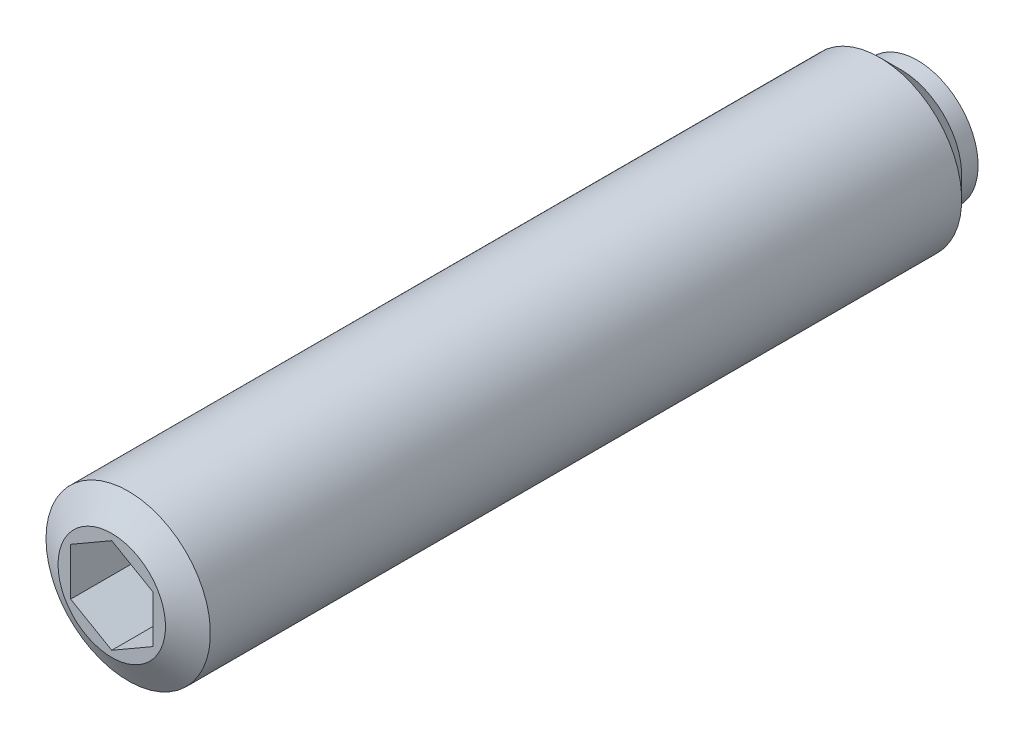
ISO-10303-21;
HEADER;
FILE_DESCRIPTION(('STEP AP214'),'2;1');
FILE_NAME('part.step','',(''),(''),'','','');
FILE_SCHEMA(('AUTOMOTIVE_DESIGN { 1 0 10303 214 1 1 1 1 }'));
ENDSEC;
DATA;
#1=APPLICATION_CONTEXT('core data for automotive mechanical design processes');
#2=APPLICATION_PROTOCOL_DEFINITION('international standard','automotive_design',2000,#1);
#3=PRODUCT_CONTEXT('',#1,'mechanical');
#4=PRODUCT('Part','Part','',(#3));
#5=PRODUCT_RELATED_PRODUCT_CATEGORY('part','',(#4));
#6=PRODUCT_DEFINITION_FORMATION('','',#4);
#7=PRODUCT_DEFINITION_CONTEXT('part definition',#1,'design');
#8=PRODUCT_DEFINITION('design','',#6,#7);
#9=PRODUCT_DEFINITION_SHAPE('','',#8);
#10=(LENGTH_UNIT() NAMED_UNIT(*) SI_UNIT(.MILLI.,.METRE.));
#11=(NAMED_UNIT(*) PLANE_ANGLE_UNIT() SI_UNIT($,.RADIAN.));
#12=(NAMED_UNIT(*) SI_UNIT($,.STERADIAN.) SOLID_ANGLE_UNIT());
#13=UNCERTAINTY_MEASURE_WITH_UNIT(LENGTH_MEASURE(1.E-05),#10,'distance_accuracy_value','');
#14=(GEOMETRIC_REPRESENTATION_CONTEXT(3) GLOBAL_UNCERTAINTY_ASSIGNED_CONTEXT((#13)) GLOBAL_UNIT_ASSIGNED_CONTEXT((#10,
#11,#12)) REPRESENTATION_CONTEXT('',''));
#15=CARTESIAN_POINT('',(0.,0.,0.));
#16=DIRECTION('',(0.,0.,1.));
#17=DIRECTION('',(1.,0.,0.));
#18=AXIS2_PLACEMENT_3D('',#15,#16,#17);
#19=CARTESIAN_POINT('',(0.,1.01980390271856,0.));
#20=DIRECTION('',(0.,0.,1.));
#21=DIRECTION('',(-1.,0.,0.));
#22=AXIS2_PLACEMENT_3D('',#19,#20,#21);
#23=PLANE('',#22);
#24=CARTESIAN_POINT('',(0.,0.,0.));
#25=DIRECTION('',(0.,0.,1.));
#26=DIRECTION('',(-1.,0.,0.));
#27=AXIS2_PLACEMENT_3D('',#24,#25,#26);
#28=CIRCLE('',#27,1.01980390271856);
#29=CARTESIAN_POINT('',(0.,1.01980390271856,0.));
#30=VERTEX_POINT('',#29);
#31=EDGE_CURVE('E9',#30,#30,#28,.T.);
#32=ORIENTED_EDGE('',*,*,#31,.F.);
#33=EDGE_LOOP('',(#32));
#34=FACE_BOUND('',#33,.T.);
#35=ADVANCED_FACE('F14',(#34),#23,.F.);
#36=CARTESIAN_POINT('',(0.,0.,1.1));
#37=DIRECTION('',(0.,0.,1.));
#38=DIRECTION('',(0.,1.,0.));
#39=AXIS2_PLACEMENT_3D('',#36,#37,#38);
#40=SPHERICAL_SURFACE('',#39,1.5);
#41=CARTESIAN_POINT('',(0.,0.,0.3));
#42=DIRECTION('',(0.,0.,1.));
#43=DIRECTION('',(-1.,0.,0.));
#44=AXIS2_PLACEMENT_3D('',#41,#42,#43);
#45=CIRCLE('',#44,1.26885775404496);
#46=CARTESIAN_POINT('',(0.,1.26885775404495,0.3));
#47=VERTEX_POINT('',#46);
#48=EDGE_CURVE('E21',#47,#47,#45,.T.);
#49=CARTESIAN_POINT('',(0.,1.26885775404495,0.3));
#50=CARTESIAN_POINT('',(0.,1.26668545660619,0.296554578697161));
#51=CARTESIAN_POINT('',(0.,1.26449912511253,0.293118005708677));
#52=CARTESIAN_POINT('',(0.,1.26009854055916,0.286262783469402));
#53=CARTESIAN_POINT('',(0.,1.25788428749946,0.28284413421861));
#54=CARTESIAN_POINT('',(0.,1.25342800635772,0.276024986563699));
#55=CARTESIAN_POINT('',(0.,1.2511859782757,0.27262448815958));
#56=CARTESIAN_POINT('',(0.,1.24667429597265,0.265841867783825));
#57=CARTESIAN_POINT('',(0.,1.24440464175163,0.26245974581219));
#58=CARTESIAN_POINT('',(0.,1.23983785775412,0.255714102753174));
#59=CARTESIAN_POINT('',(0.,1.23754072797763,0.252350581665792));
#60=CARTESIAN_POINT('',(0.,1.23291914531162,0.245642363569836));
#61=CARTESIAN_POINT('',(0.,1.23059469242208,0.242297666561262));
#62=CARTESIAN_POINT('',(0.,1.22591861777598,0.235627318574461));
#63=CARTESIAN_POINT('',(0.,1.2235669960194,0.232301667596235));
#64=CARTESIAN_POINT('',(0.,1.21883673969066,0.225669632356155));
#65=CARTESIAN_POINT('',(0.,1.2164581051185,0.222363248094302));
#66=CARTESIAN_POINT('',(0.,1.21167398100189,0.215769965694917));
#67=CARTESIAN_POINT('',(0.,1.20926849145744,0.212483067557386));
#68=CARTESIAN_POINT('',(0.,1.20443081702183,0.205928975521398));
#69=CARTESIAN_POINT('',(0.,1.20199863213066,0.202661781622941));
#70=CARTESIAN_POINT('',(0.,1.19710772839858,0.196147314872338));
#71=CARTESIAN_POINT('',(0.,1.19464900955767,0.192900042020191));
#72=CARTESIAN_POINT('',(0.,1.18970520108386,0.186425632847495));
#73=CARTESIAN_POINT('',(0.,1.18722011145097,0.183198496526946));
#74=CARTESIAN_POINT('',(0.,1.18222372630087,0.176764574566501));
#75=CARTESIAN_POINT('',(0.,1.17971243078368,0.173557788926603));
#76=CARTESIAN_POINT('',(0.,1.17466380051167,0.167164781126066));
#77=CARTESIAN_POINT('',(0.,1.17212646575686,0.163978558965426));
#78=CARTESIAN_POINT('',(0.,1.16702592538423,0.157626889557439));
#79=CARTESIAN_POINT('',(0.,1.16446271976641,0.154461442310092));
#80=CARTESIAN_POINT('',(0.,1.15931060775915,0.148151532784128));
#81=CARTESIAN_POINT('',(0.,1.15672170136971,0.145007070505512));
#82=CARTESIAN_POINT('',(0.,1.15151835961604,0.138739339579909));
#83=CARTESIAN_POINT('',(0.,1.14890392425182,0.135616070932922));
#84=CARTESIAN_POINT('',(0.,1.14364969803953,0.129390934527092));
#85=CARTESIAN_POINT('',(0.,1.14100990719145,0.126289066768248));
#86=CARTESIAN_POINT('',(0.,1.13570514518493,0.120106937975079));
#87=CARTESIAN_POINT('',(0.,1.13304017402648,0.117026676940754));
#88=CARTESIAN_POINT('',(0.,1.12768522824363,0.1108879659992));
#89=CARTESIAN_POINT('',(0.,1.12499525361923,0.107829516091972));
#90=CARTESIAN_POINT('',(0.,1.1195904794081,0.101734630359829));
#91=CARTESIAN_POINT('',(0.,1.11687567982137,0.0986981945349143));
#92=CARTESIAN_POINT('',(0.,1.11142143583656,0.0926475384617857));
#93=CARTESIAN_POINT('',(0.,1.10868199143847,0.0896333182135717));
#94=CARTESIAN_POINT('',(0.,1.10317863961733,0.0836272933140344));
#95=CARTESIAN_POINT('',(0.,1.10041473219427,0.080635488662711));
#96=CARTESIAN_POINT('',(0.,1.09486263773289,0.0746744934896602));
#97=CARTESIAN_POINT('',(0.,1.09207445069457,0.0717053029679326));
#98=CARTESIAN_POINT('',(0.,1.08647398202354,0.0657897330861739));
#99=CARTESIAN_POINT('',(0.,1.08366170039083,0.0628433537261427));
#100=CARTESIAN_POINT('',(0.,1.07801322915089,0.0569736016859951));
#101=CARTESIAN_POINT('',(0.,1.07517703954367,0.0540502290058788));
#102=CARTESIAN_POINT('',(0.,1.06948094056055,0.0482266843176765));
#103=CARTESIAN_POINT('',(0.,1.06662103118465,0.0453265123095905));
#104=CARTESIAN_POINT('',(0.,1.06087768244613,0.0395495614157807));
#105=CARTESIAN_POINT('',(0.,1.0579942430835,0.036672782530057));
#106=CARTESIAN_POINT('',(0.,1.0522040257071,0.0309428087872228));
#107=CARTESIAN_POINT('',(0.,1.04929724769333,0.0280896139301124));
#108=CARTESIAN_POINT('',(0.,1.04346054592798,0.0224069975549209));
#109=CARTESIAN_POINT('',(0.,1.0405306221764,0.01957757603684));
#110=CARTESIAN_POINT('',(0.,1.03464782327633,0.013942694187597));
#111=CARTESIAN_POINT('',(0.,1.03169494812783,0.011137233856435));
#112=CARTESIAN_POINT('',(0.,1.02576644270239,0.00555046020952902));
#113=CARTESIAN_POINT('',(0.,1.02279081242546,0.00276914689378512));
#114=CARTESIAN_POINT('',(0.,1.01980390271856,0.));
#115=B_SPLINE_CURVE_WITH_KNOTS('',3,(#49,#50,#51,#52,#53,#54,#55,#56,#57,#58,#59,#60,#61,#62,
#63,#64,#65,#66,#67,#68,#69,#70,#71,#72,#73,#74,#75,#76,#77,#78,#79,#80,#81,#82,#83,#84,#85,#86,
#87,#88,#89,#90,#91,#92,#93,#94,#95,#96,#97,#98,#99,#100,#101,#102,#103,#104,#105,#106,#107,
#108,#109,#110,#111,#112,#113,#114),.UNSPECIFIED.,.F.,.F.,(4,2,2,2,2,2,2,2,2,2,2,2,2,2,2,2,2,2,
2,2,2,2,2,2,2,2,2,2,2,2,2,2,4),(0.,0.0122191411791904,0.0244382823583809,0.0366574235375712,
0.0488765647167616,0.061095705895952,0.0733148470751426,0.0855339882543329,0.0977531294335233,
0.109972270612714,0.122191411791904,0.134410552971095,0.146629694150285,0.158848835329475,
0.171067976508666,0.183287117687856,0.195506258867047,0.207725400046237,0.219944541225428,
0.232163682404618,0.244382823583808,0.256601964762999,0.268821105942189,0.281040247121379,
0.29325938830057,0.30547852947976,0.317697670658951,0.329916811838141,0.342135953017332,
0.354355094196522,0.366574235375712,0.378793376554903,0.391012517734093),.UNSPECIFIED.);
#116=EDGE_CURVE('BSEAM141',#47,#30,#115,.T.);
#117=ORIENTED_EDGE('',*,*,#48,.F.);
#118=ORIENTED_EDGE('',*,*,#31,.T.);
#119=ORIENTED_EDGE('',*,*,#116,.T.);
#120=ORIENTED_EDGE('',*,*,#116,.F.);
#121=EDGE_LOOP('',(#117,#119,#118,#120));
#122=FACE_BOUND('',#121,.T.);
#123=ADVANCED_FACE('F141',(#122),#40,.T.);
#124=CARTESIAN_POINT('',(0.,1.85,0.3));
#125=DIRECTION('',(0.,0.,1.));
#126=DIRECTION('',(-1.,0.,0.));
#127=AXIS2_PLACEMENT_3D('',#124,#125,#126);
#128=PLANE('',#127);
#129=CARTESIAN_POINT('',(0.,0.,0.3));
#130=DIRECTION('',(0.,0.,1.));
#131=DIRECTION('',(-1.,0.,0.));
#132=AXIS2_PLACEMENT_3D('',#129,#130,#131);
#133=CIRCLE('',#132,1.85);
#134=CARTESIAN_POINT('',(-1.85,0.,0.3));
#135=VERTEX_POINT('',#134);
#136=EDGE_CURVE('E134',#135,#135,#133,.T.);
#137=ORIENTED_EDGE('',*,*,#136,.F.);
#138=EDGE_LOOP('',(#137));
#139=FACE_BOUND('',#138,.T.);
#140=ORIENTED_EDGE('',*,*,#48,.T.);
#141=EDGE_LOOP('',(#140));
#142=FACE_BOUND('',#141,.T.);
#143=ADVANCED_FACE('F139',(#139,#142),#128,.F.);
#144=CARTESIAN_POINT('',(0.,0.,26.1950749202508));
#145=DIRECTION('',(0.,0.,1.));
#146=DIRECTION('',(-1.,0.,0.));
#147=AXIS2_PLACEMENT_3D('',#144,#145,#146);
#148=CYLINDRICAL_SURFACE('',#147,1.85);
#149=CARTESIAN_POINT('',(0.,0.,0.8));
#150=DIRECTION('',(0.,0.,1.));
#151=DIRECTION('',(-1.,0.,0.));
#152=AXIS2_PLACEMENT_3D('',#149,#150,#151);
#153=CIRCLE('',#152,1.85);
#154=CARTESIAN_POINT('',(-1.85,0.,0.8));
#155=VERTEX_POINT('',#154);
#156=EDGE_CURVE('E131',#155,#155,#153,.T.);
#157=ORIENTED_EDGE('',*,*,#156,.F.);
#158=EDGE_LOOP('',(#157));
#159=FACE_BOUND('',#158,.T.);
#160=ORIENTED_EDGE('',*,*,#136,.T.);
#161=EDGE_LOOP('',(#160));
#162=FACE_BOUND('',#161,.T.);
#163=ADVANCED_FACE('F164',(#159,#162),#148,.T.);
#164=CARTESIAN_POINT('',(0.,0.,0.8));
#165=DIRECTION('',(0.,0.,1.));
#166=DIRECTION('',(-1.,0.,0.));
#167=AXIS2_PLACEMENT_3D('',#164,#165,#166);
#168=CONICAL_SURFACE('',#167,1.85,0.785398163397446);
#169=CARTESIAN_POINT('',(0.,0.,1.45));
#170=DIRECTION('',(0.,0.,1.));
#171=DIRECTION('',(-1.,0.,0.));
#172=AXIS2_PLACEMENT_3D('',#169,#170,#171);
#173=CIRCLE('',#172,2.5);
#174=CARTESIAN_POINT('',(-2.5,0.,1.45));
#175=VERTEX_POINT('',#174);
#176=EDGE_CURVE('E128',#175,#175,#173,.T.);
#177=ORIENTED_EDGE('',*,*,#176,.F.);
#178=EDGE_LOOP('',(#177));
#179=FACE_BOUND('',#178,.T.);
#180=ORIENTED_EDGE('',*,*,#156,.T.);
#181=EDGE_LOOP('',(#180));
#182=FACE_BOUND('',#181,.T.);
#183=ADVANCED_FACE('F173',(#179,#182),#168,.T.);
#184=CARTESIAN_POINT('',(0.,0.,26.1950749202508));
#185=DIRECTION('',(0.,0.,1.));
#186=DIRECTION('',(-1.,0.,0.));
#187=AXIS2_PLACEMENT_3D('',#184,#185,#186);
#188=CYLINDRICAL_SURFACE('',#187,2.5);
#189=CARTESIAN_POINT('',(0.,0.,24.3));
#190=DIRECTION('',(0.,0.,1.));
#191=DIRECTION('',(-1.,0.,0.));
#192=AXIS2_PLACEMENT_3D('',#189,#190,#191);
#193=CIRCLE('',#192,2.5);
#194=CARTESIAN_POINT('',(-2.5,0.,24.3));
#195=VERTEX_POINT('',#194);
#196=EDGE_CURVE('E125',#195,#195,#193,.T.);
#197=ORIENTED_EDGE('',*,*,#196,.F.);
#198=EDGE_LOOP('',(#197));
#199=FACE_BOUND('',#198,.T.);
#200=ORIENTED_EDGE('',*,*,#176,.T.);
#201=EDGE_LOOP('',(#200));
#202=FACE_BOUND('',#201,.T.);
#203=ADVANCED_FACE('F182',(#199,#202),#188,.T.);
#204=CARTESIAN_POINT('',(0.,0.,24.3));
#205=DIRECTION('',(0.,0.,-1.));
#206=DIRECTION('',(1.,0.,0.));
#207=AXIS2_PLACEMENT_3D('',#204,#205,#206);
#208=CONICAL_SURFACE('',#207,2.5,1.04719755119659);
#209=CARTESIAN_POINT('',(0.,0.,24.8));
#210=DIRECTION('',(0.,0.,1.));
#211=DIRECTION('',(-1.,0.,0.));
#212=AXIS2_PLACEMENT_3D('',#209,#210,#211);
#213=CIRCLE('',#212,1.63397459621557);
#214=CARTESIAN_POINT('',(-1.63397459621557,0.,24.8));
#215=VERTEX_POINT('',#214);
#216=EDGE_CURVE('E116',#215,#215,#213,.T.);
#217=ORIENTED_EDGE('',*,*,#216,.F.);
#218=EDGE_LOOP('',(#217));
#219=FACE_BOUND('',#218,.T.);
#220=ORIENTED_EDGE('',*,*,#196,.T.);
#221=EDGE_LOOP('',(#220));
#222=FACE_BOUND('',#221,.T.);
#223=ADVANCED_FACE('F191',(#219,#222),#208,.T.);
#224=CARTESIAN_POINT('',(0.,0.,24.8));
#225=DIRECTION('',(0.,0.,-1.));
#226=DIRECTION('',(1.,0.,0.));
#227=AXIS2_PLACEMENT_3D('',#224,#225,#226);
#228=PLANE('',#227);
#229=DIRECTION('',(-0.866025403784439,-0.5,0.));
#230=VECTOR('',#229,1.);
#231=CARTESIAN_POINT('',(0.,1.44337567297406,24.8));
#232=LINE('',#231,#230);
#233=CARTESIAN_POINT('',(0.,1.44337567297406,24.8));
#234=VERTEX_POINT('',#233);
#235=CARTESIAN_POINT('',(-1.25,0.721687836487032,24.8));
#236=VERTEX_POINT('',#235);
#237=EDGE_CURVE('E82',#234,#236,#232,.T.);
#238=ORIENTED_EDGE('',*,*,#237,.F.);
#239=DIRECTION('',(-0.866025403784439,0.5,0.));
#240=VECTOR('',#239,1.);
#241=CARTESIAN_POINT('',(1.25,0.721687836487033,24.8));
#242=LINE('',#241,#240);
#243=CARTESIAN_POINT('',(1.25,0.721687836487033,24.8));
#244=VERTEX_POINT('',#243);
#245=EDGE_CURVE('E28',#244,#234,#242,.T.);
#246=ORIENTED_EDGE('',*,*,#245,.F.);
#247=DIRECTION('',(0.,1.,0.));
#248=VECTOR('',#247,1.);
#249=CARTESIAN_POINT('',(1.25,-0.721687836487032,24.8));
#250=LINE('',#249,#248);
#251=CARTESIAN_POINT('',(1.25,-0.721687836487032,24.8));
#252=VERTEX_POINT('',#251);
#253=EDGE_CURVE('E98',#252,#244,#250,.T.);
#254=ORIENTED_EDGE('',*,*,#253,.F.);
#255=DIRECTION('',(0.866025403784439,0.5,0.));
#256=VECTOR('',#255,1.);
#257=CARTESIAN_POINT('',(0.,-1.44337567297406,24.8));
#258=LINE('',#257,#256);
#259=CARTESIAN_POINT('',(0.,-1.44337567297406,24.8));
#260=VERTEX_POINT('',#259);
#261=EDGE_CURVE('E92',#260,#252,#258,.T.);
#262=ORIENTED_EDGE('',*,*,#261,.F.);
#263=DIRECTION('',(0.866025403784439,-0.5,0.));
#264=VECTOR('',#263,1.);
#265=CARTESIAN_POINT('',(-1.25,-0.721687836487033,24.8));
#266=LINE('',#265,#264);
#267=CARTESIAN_POINT('',(-1.25,-0.721687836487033,24.8));
#268=VERTEX_POINT('',#267);
#269=EDGE_CURVE('E90',#268,#260,#266,.T.);
#270=ORIENTED_EDGE('',*,*,#269,.F.);
#271=DIRECTION('',(0.,-1.,0.));
#272=VECTOR('',#271,1.);
#273=CARTESIAN_POINT('',(-1.25,0.721687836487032,24.8));
#274=LINE('',#273,#272);
#275=EDGE_CURVE('E71',#236,#268,#274,.T.);
#276=ORIENTED_EDGE('',*,*,#275,.F.);
#277=EDGE_LOOP('',(#238,#246,#254,#262,#270,#276));
#278=FACE_BOUND('',#277,.T.);
#279=ORIENTED_EDGE('',*,*,#216,.T.);
#280=EDGE_LOOP('',(#279));
#281=FACE_BOUND('',#280,.T.);
#282=ADVANCED_FACE('F86',(#278,#281),#228,.F.);
#283=CARTESIAN_POINT('',(1.25,0.721687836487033,21.8));
#284=DIRECTION('',(0.5,0.866025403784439,0.));
#285=DIRECTION('',(0.866025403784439,-0.5,0.));
#286=AXIS2_PLACEMENT_3D('',#283,#284,#285);
#287=PLANE('',#286);
#288=ORIENTED_EDGE('',*,*,#245,.T.);
#289=DIRECTION('',(0.,0.,1.));
#290=VECTOR('',#289,1.);
#291=CARTESIAN_POINT('',(0.,1.44337567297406,21.8));
#292=LINE('',#291,#290);
#293=CARTESIAN_POINT('',(0.,1.44337567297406,21.8));
#294=VERTEX_POINT('',#293);
#295=EDGE_CURVE('E79',#294,#234,#292,.T.);
#296=ORIENTED_EDGE('',*,*,#295,.F.);
#297=DIRECTION('',(-0.866025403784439,0.5,0.));
#298=VECTOR('',#297,1.);
#299=CARTESIAN_POINT('',(1.25,0.721687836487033,21.8));
#300=LINE('',#299,#298);
#301=CARTESIAN_POINT('',(1.25,0.721687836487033,21.8));
#302=VERTEX_POINT('',#301);
#303=EDGE_CURVE('E100',#302,#294,#300,.T.);
#304=ORIENTED_EDGE('',*,*,#303,.F.);
#305=DIRECTION('',(0.,0.,1.));
#306=VECTOR('',#305,1.);
#307=CARTESIAN_POINT('',(1.25,0.721687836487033,21.8));
#308=LINE('',#307,#306);
#309=EDGE_CURVE('E35',#302,#244,#308,.T.);
#310=ORIENTED_EDGE('',*,*,#309,.T.);
#311=EDGE_LOOP('',(#288,#296,#304,#310));
#312=FACE_BOUND('',#311,.T.);
#313=ADVANCED_FACE('F208',(#312),#287,.F.);
#314=CARTESIAN_POINT('',(1.25,-0.721687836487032,21.8));
#315=DIRECTION('',(1.,0.,0.));
#316=DIRECTION('',(0.,-1.,0.));
#317=AXIS2_PLACEMENT_3D('',#314,#315,#316);
#318=PLANE('',#317);
#319=ORIENTED_EDGE('',*,*,#253,.T.);
#320=ORIENTED_EDGE('',*,*,#309,.F.);
#321=DIRECTION('',(0.,1.,0.));
#322=VECTOR('',#321,1.);
#323=CARTESIAN_POINT('',(1.25,-0.721687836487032,21.8));
#324=LINE('',#323,#322);
#325=CARTESIAN_POINT('',(1.25,-0.721687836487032,21.8));
#326=VERTEX_POINT('',#325);
#327=EDGE_CURVE('E112',#326,#302,#324,.T.);
#328=ORIENTED_EDGE('',*,*,#327,.F.);
#329=DIRECTION('',(0.,0.,1.));
#330=VECTOR('',#329,1.);
#331=CARTESIAN_POINT('',(1.25,-0.721687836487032,21.8));
#332=LINE('',#331,#330);
#333=EDGE_CURVE('E117',#326,#252,#332,.T.);
#334=ORIENTED_EDGE('',*,*,#333,.T.);
#335=EDGE_LOOP('',(#319,#320,#328,#334));
#336=FACE_BOUND('',#335,.T.);
#337=ADVANCED_FACE('F216',(#336),#318,.F.);
#338=CARTESIAN_POINT('',(0.,-1.44337567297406,21.8));
#339=DIRECTION('',(0.5,-0.866025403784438,0.));
#340=DIRECTION('',(-0.866025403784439,-0.5,0.));
#341=AXIS2_PLACEMENT_3D('',#338,#339,#340);
#342=PLANE('',#341);
#343=ORIENTED_EDGE('',*,*,#261,.T.);
#344=ORIENTED_EDGE('',*,*,#333,.F.);
#345=DIRECTION('',(0.866025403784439,0.5,0.));
#346=VECTOR('',#345,1.);
#347=CARTESIAN_POINT('',(0.,-1.44337567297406,21.8));
#348=LINE('',#347,#346);
#349=CARTESIAN_POINT('',(0.,-1.44337567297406,21.8));
#350=VERTEX_POINT('',#349);
#351=EDGE_CURVE('E109',#350,#326,#348,.T.);
#352=ORIENTED_EDGE('',*,*,#351,.F.);
#353=DIRECTION('',(0.,0.,1.));
#354=VECTOR('',#353,1.);
#355=CARTESIAN_POINT('',(0.,-1.44337567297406,21.8));
#356=LINE('',#355,#354);
#357=EDGE_CURVE('E119',#350,#260,#356,.T.);
#358=ORIENTED_EDGE('',*,*,#357,.T.);
#359=EDGE_LOOP('',(#343,#344,#352,#358));
#360=FACE_BOUND('',#359,.T.);
#361=ADVANCED_FACE('F224',(#360),#342,.F.);
#362=CARTESIAN_POINT('',(-1.25,-0.721687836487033,21.8));
#363=DIRECTION('',(-0.5,-0.866025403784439,0.));
#364=DIRECTION('',(-0.866025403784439,0.5,0.));
#365=AXIS2_PLACEMENT_3D('',#362,#363,#364);
#366=PLANE('',#365);
#367=ORIENTED_EDGE('',*,*,#269,.T.);
#368=ORIENTED_EDGE('',*,*,#357,.F.);
#369=DIRECTION('',(0.866025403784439,-0.5,0.));
#370=VECTOR('',#369,1.);
#371=CARTESIAN_POINT('',(-1.25,-0.721687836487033,21.8));
#372=LINE('',#371,#370);
#373=CARTESIAN_POINT('',(-1.25,-0.721687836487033,21.8));
#374=VERTEX_POINT('',#373);
#375=EDGE_CURVE('E106',#374,#350,#372,.T.);
#376=ORIENTED_EDGE('',*,*,#375,.F.);
#377=DIRECTION('',(0.,0.,1.));
#378=VECTOR('',#377,1.);
#379=CARTESIAN_POINT('',(-1.25,-0.721687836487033,21.8));
#380=LINE('',#379,#378);
#381=EDGE_CURVE('E78',#374,#268,#380,.T.);
#382=ORIENTED_EDGE('',*,*,#381,.T.);
#383=EDGE_LOOP('',(#367,#368,#376,#382));
#384=FACE_BOUND('',#383,.T.);
#385=ADVANCED_FACE('F232',(#384),#366,.F.);
#386=CARTESIAN_POINT('',(-1.25,0.721687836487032,21.8));
#387=DIRECTION('',(-1.,0.,0.));
#388=DIRECTION('',(0.,1.,0.));
#389=AXIS2_PLACEMENT_3D('',#386,#387,#388);
#390=PLANE('',#389);
#391=ORIENTED_EDGE('',*,*,#275,.T.);
#392=ORIENTED_EDGE('',*,*,#381,.F.);
#393=DIRECTION('',(0.,-1.,0.));
#394=VECTOR('',#393,1.);
#395=CARTESIAN_POINT('',(-1.25,0.721687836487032,21.8));
#396=LINE('',#395,#394);
#397=CARTESIAN_POINT('',(-1.25,0.721687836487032,21.8));
#398=VERTEX_POINT('',#397);
#399=EDGE_CURVE('E74',#398,#374,#396,.T.);
#400=ORIENTED_EDGE('',*,*,#399,.F.);
#401=DIRECTION('',(0.,0.,1.));
#402=VECTOR('',#401,1.);
#403=CARTESIAN_POINT('',(-1.25,0.721687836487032,21.8));
#404=LINE('',#403,#402);
#405=EDGE_CURVE('E67',#398,#236,#404,.T.);
#406=ORIENTED_EDGE('',*,*,#405,.T.);
#407=EDGE_LOOP('',(#391,#392,#400,#406));
#408=FACE_BOUND('',#407,.T.);
#409=ADVANCED_FACE('F69',(#408),#390,.F.);
#410=CARTESIAN_POINT('',(0.,1.44337567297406,21.8));
#411=DIRECTION('',(-0.5,0.866025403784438,0.));
#412=DIRECTION('',(0.866025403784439,0.5,0.));
#413=AXIS2_PLACEMENT_3D('',#410,#411,#412);
#414=PLANE('',#413);
#415=ORIENTED_EDGE('',*,*,#237,.T.);
#416=ORIENTED_EDGE('',*,*,#405,.F.);
#417=DIRECTION('',(-0.866025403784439,-0.5,0.));
#418=VECTOR('',#417,1.);
#419=CARTESIAN_POINT('',(0.,1.44337567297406,21.8));
#420=LINE('',#419,#418);
#421=EDGE_CURVE('E103',#294,#398,#420,.T.);
#422=ORIENTED_EDGE('',*,*,#421,.F.);
#423=ORIENTED_EDGE('',*,*,#295,.T.);
#424=EDGE_LOOP('',(#415,#416,#422,#423));
#425=FACE_BOUND('',#424,.T.);
#426=ADVANCED_FACE('F83',(#425),#414,.F.);
#427=CARTESIAN_POINT('',(2.5,0.,21.8));
#428=DIRECTION('',(0.,0.,-1.));
#429=DIRECTION('',(1.,0.,0.));
#430=AXIS2_PLACEMENT_3D('',#427,#428,#429);
#431=PLANE('',#430);
#432=ORIENTED_EDGE('',*,*,#303,.T.);
#433=ORIENTED_EDGE('',*,*,#421,.T.);
#434=ORIENTED_EDGE('',*,*,#399,.T.);
#435=ORIENTED_EDGE('',*,*,#375,.T.);
#436=ORIENTED_EDGE('',*,*,#351,.T.);
#437=ORIENTED_EDGE('',*,*,#327,.T.);
#438=EDGE_LOOP('',(#432,#433,#434,#435,#436,#437));
#439=FACE_BOUND('',#438,.T.);
#440=ADVANCED_FACE('F256',(#439),#431,.F.);
#441=CLOSED_SHELL('',(#35,#123,#143,#163,#183,#203,#223,#282,#313,#337,#361,#385,#409,#426,#440));
#442=MANIFOLD_SOLID_BREP('B1',#441);
#443=ADVANCED_BREP_SHAPE_REPRESENTATION('',(#18,#442),#14);
#444=SHAPE_DEFINITION_REPRESENTATION(#9,#443);
ENDSEC;
END-ISO-10303-21;
